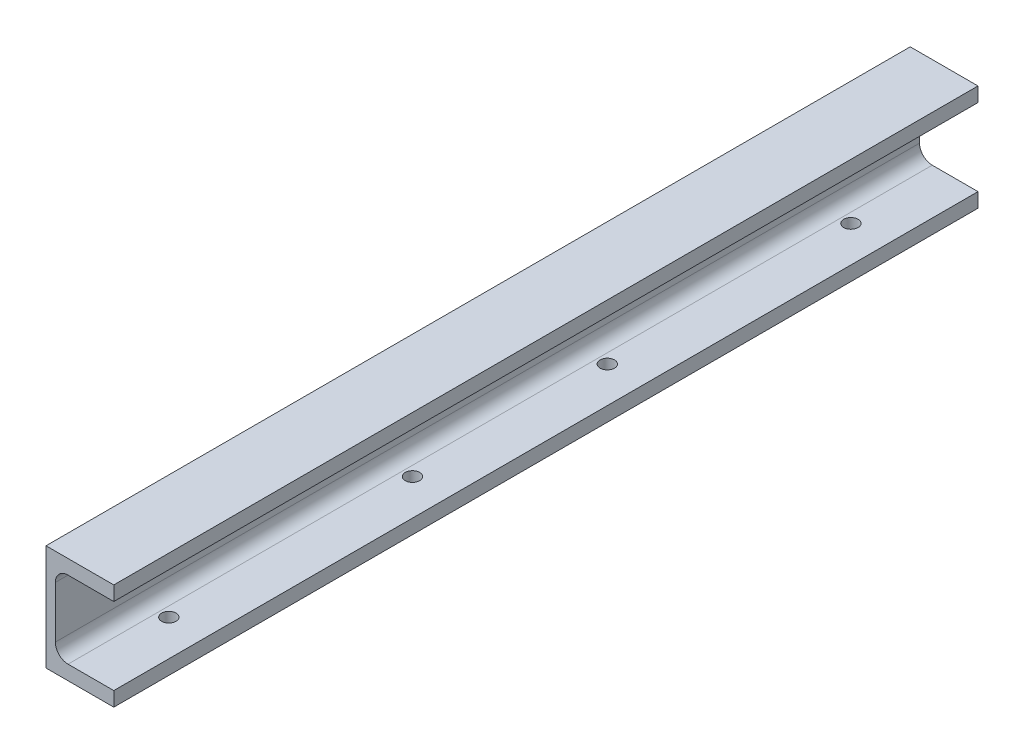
ISO-10303-21;
HEADER;
FILE_DESCRIPTION(('STEP AP214'),'2;1');
FILE_NAME('part.step','',(''),(''),'','','');
FILE_SCHEMA(('AUTOMOTIVE_DESIGN { 1 0 10303 214 1 1 1 1 }'));
ENDSEC;
DATA;
#1=APPLICATION_CONTEXT('core data for automotive mechanical design processes');
#2=APPLICATION_PROTOCOL_DEFINITION('international standard','automotive_design',2000,#1);
#3=PRODUCT_CONTEXT('',#1,'mechanical');
#4=PRODUCT('Part','Part','',(#3));
#5=PRODUCT_RELATED_PRODUCT_CATEGORY('part','',(#4));
#6=PRODUCT_DEFINITION_FORMATION('','',#4);
#7=PRODUCT_DEFINITION_CONTEXT('part definition',#1,'design');
#8=PRODUCT_DEFINITION('design','',#6,#7);
#9=PRODUCT_DEFINITION_SHAPE('','',#8);
#10=(LENGTH_UNIT() NAMED_UNIT(*) SI_UNIT(.MILLI.,.METRE.));
#11=(NAMED_UNIT(*) PLANE_ANGLE_UNIT() SI_UNIT($,.RADIAN.));
#12=(NAMED_UNIT(*) SI_UNIT($,.STERADIAN.) SOLID_ANGLE_UNIT());
#13=UNCERTAINTY_MEASURE_WITH_UNIT(LENGTH_MEASURE(1.E-05),#10,'distance_accuracy_value','');
#14=(GEOMETRIC_REPRESENTATION_CONTEXT(3) GLOBAL_UNCERTAINTY_ASSIGNED_CONTEXT((#13)) GLOBAL_UNIT_ASSIGNED_CONTEXT((#10,
#11,#12)) REPRESENTATION_CONTEXT('',''));
#15=CARTESIAN_POINT('',(0.,0.,0.));
#16=DIRECTION('',(0.,0.,1.));
#17=DIRECTION('',(1.,0.,0.));
#18=AXIS2_PLACEMENT_3D('',#15,#16,#17);
#19=CARTESIAN_POINT('',(-5.60000000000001,12.2,204.));
#20=DIRECTION('',(0.,0.,-1.));
#21=DIRECTION('',(-1.,0.,0.));
#22=AXIS2_PLACEMENT_3D('',#19,#20,#21);
#23=CYLINDRICAL_SURFACE('',#22,6.);
#24=CARTESIAN_POINT('',(-5.60000000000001,12.2,-204.));
#25=DIRECTION('',(0.,0.,-1.));
#26=DIRECTION('',(-1.,0.,0.));
#27=AXIS2_PLACEMENT_3D('',#24,#25,#26);
#28=CIRCLE('',#27,6.);
#29=CARTESIAN_POINT('',(-11.6,12.2,-204.));
#30=VERTEX_POINT('',#29);
#31=CARTESIAN_POINT('',(-5.60000000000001,18.2,-204.));
#32=VERTEX_POINT('',#31);
#33=EDGE_CURVE('E146',#30,#32,#28,.T.);
#34=ORIENTED_EDGE('',*,*,#33,.T.);
#35=DIRECTION('',(0.,0.,-1.));
#36=VECTOR('',#35,1.);
#37=CARTESIAN_POINT('',(-5.60000000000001,18.2,204.));
#38=LINE('',#37,#36);
#39=CARTESIAN_POINT('',(-5.60000000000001,18.2,204.));
#40=VERTEX_POINT('',#39);
#41=EDGE_CURVE('E11',#40,#32,#38,.T.);
#42=ORIENTED_EDGE('',*,*,#41,.F.);
#43=CARTESIAN_POINT('',(-5.60000000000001,12.2,204.));
#44=DIRECTION('',(0.,0.,-1.));
#45=DIRECTION('',(-1.,0.,0.));
#46=AXIS2_PLACEMENT_3D('',#43,#44,#45);
#47=CIRCLE('',#46,6.);
#48=CARTESIAN_POINT('',(-11.6,12.2,204.));
#49=VERTEX_POINT('',#48);
#50=EDGE_CURVE('E165',#49,#40,#47,.T.);
#51=ORIENTED_EDGE('',*,*,#50,.F.);
#52=DIRECTION('',(0.,0.,-1.));
#53=VECTOR('',#52,1.);
#54=CARTESIAN_POINT('',(-11.6,12.2,204.));
#55=LINE('',#54,#53);
#56=EDGE_CURVE('E142',#49,#30,#55,.T.);
#57=ORIENTED_EDGE('',*,*,#56,.T.);
#58=EDGE_LOOP('',(#34,#42,#51,#57));
#59=FACE_BOUND('',#58,.T.);
#60=ADVANCED_FACE('F36',(#59),#23,.F.);
#61=CARTESIAN_POINT('',(16.,18.2,204.));
#62=DIRECTION('',(0.,1.,0.));
#63=DIRECTION('',(0.,0.,1.));
#64=AXIS2_PLACEMENT_3D('',#61,#62,#63);
#65=PLANE('',#64);
#66=DIRECTION('',(1.,0.,0.));
#67=VECTOR('',#66,1.);
#68=CARTESIAN_POINT('',(16.,18.2,-204.));
#69=LINE('',#68,#67);
#70=CARTESIAN_POINT('',(16.,18.2,-204.));
#71=VERTEX_POINT('',#70);
#72=EDGE_CURVE('E149',#32,#71,#69,.T.);
#73=ORIENTED_EDGE('',*,*,#72,.T.);
#74=DIRECTION('',(0.,0.,-1.));
#75=VECTOR('',#74,1.);
#76=CARTESIAN_POINT('',(16.,18.2,204.));
#77=LINE('',#76,#75);
#78=CARTESIAN_POINT('',(16.,18.2,204.));
#79=VERTEX_POINT('',#78);
#80=EDGE_CURVE('E45',#79,#71,#77,.T.);
#81=ORIENTED_EDGE('',*,*,#80,.F.);
#82=DIRECTION('',(1.,0.,0.));
#83=VECTOR('',#82,1.);
#84=CARTESIAN_POINT('',(16.,18.2,204.));
#85=LINE('',#84,#83);
#86=EDGE_CURVE('E103',#40,#79,#85,.T.);
#87=ORIENTED_EDGE('',*,*,#86,.F.);
#88=ORIENTED_EDGE('',*,*,#41,.T.);
#89=EDGE_LOOP('',(#73,#81,#87,#88));
#90=FACE_BOUND('',#89,.T.);
#91=ADVANCED_FACE('F243',(#90),#65,.F.);
#92=CARTESIAN_POINT('',(16.,25.,204.));
#93=DIRECTION('',(-1.,0.,0.));
#94=DIRECTION('',(0.,0.,1.));
#95=AXIS2_PLACEMENT_3D('',#92,#93,#94);
#96=PLANE('',#95);
#97=DIRECTION('',(0.,1.,0.));
#98=VECTOR('',#97,1.);
#99=CARTESIAN_POINT('',(16.,25.,-204.));
#100=LINE('',#99,#98);
#101=CARTESIAN_POINT('',(16.,25.,-204.));
#102=VERTEX_POINT('',#101);
#103=EDGE_CURVE('E152',#71,#102,#100,.T.);
#104=ORIENTED_EDGE('',*,*,#103,.T.);
#105=DIRECTION('',(0.,0.,-1.));
#106=VECTOR('',#105,1.);
#107=CARTESIAN_POINT('',(16.,25.,204.));
#108=LINE('',#107,#106);
#109=CARTESIAN_POINT('',(16.,25.,204.));
#110=VERTEX_POINT('',#109);
#111=EDGE_CURVE('E178',#110,#102,#108,.T.);
#112=ORIENTED_EDGE('',*,*,#111,.F.);
#113=DIRECTION('',(0.,1.,0.));
#114=VECTOR('',#113,1.);
#115=CARTESIAN_POINT('',(16.,25.,204.));
#116=LINE('',#115,#114);
#117=EDGE_CURVE('E208',#79,#110,#116,.T.);
#118=ORIENTED_EDGE('',*,*,#117,.F.);
#119=ORIENTED_EDGE('',*,*,#80,.T.);
#120=EDGE_LOOP('',(#104,#112,#118,#119));
#121=FACE_BOUND('',#120,.T.);
#122=ADVANCED_FACE('F247',(#121),#96,.F.);
#123=CARTESIAN_POINT('',(-16.,25.,204.));
#124=DIRECTION('',(0.,-1.,0.));
#125=DIRECTION('',(0.,0.,-1.));
#126=AXIS2_PLACEMENT_3D('',#123,#124,#125);
#127=PLANE('',#126);
#128=DIRECTION('',(-1.,0.,0.));
#129=VECTOR('',#128,1.);
#130=CARTESIAN_POINT('',(-16.,25.,-204.));
#131=LINE('',#130,#129);
#132=CARTESIAN_POINT('',(-16.,25.,-204.));
#133=VERTEX_POINT('',#132);
#134=EDGE_CURVE('E154',#102,#133,#131,.T.);
#135=ORIENTED_EDGE('',*,*,#134,.T.);
#136=DIRECTION('',(0.,0.,-1.));
#137=VECTOR('',#136,1.);
#138=CARTESIAN_POINT('',(-16.,25.,204.));
#139=LINE('',#138,#137);
#140=CARTESIAN_POINT('',(-16.,25.,204.));
#141=VERTEX_POINT('',#140);
#142=EDGE_CURVE('E175',#141,#133,#139,.T.);
#143=ORIENTED_EDGE('',*,*,#142,.F.);
#144=DIRECTION('',(-1.,0.,0.));
#145=VECTOR('',#144,1.);
#146=CARTESIAN_POINT('',(-16.,25.,204.));
#147=LINE('',#146,#145);
#148=EDGE_CURVE('E210',#110,#141,#147,.T.);
#149=ORIENTED_EDGE('',*,*,#148,.F.);
#150=ORIENTED_EDGE('',*,*,#111,.T.);
#151=EDGE_LOOP('',(#135,#143,#149,#150));
#152=FACE_BOUND('',#151,.T.);
#153=ADVANCED_FACE('F251',(#152),#127,.F.);
#154=CARTESIAN_POINT('',(-16.,25.,204.));
#155=DIRECTION('',(1.,0.,0.));
#156=DIRECTION('',(0.,0.,-1.));
#157=AXIS2_PLACEMENT_3D('',#154,#155,#156);
#158=PLANE('',#157);
#159=DIRECTION('',(0.,-1.,0.));
#160=VECTOR('',#159,1.);
#161=CARTESIAN_POINT('',(-16.,25.,-204.));
#162=LINE('',#161,#160);
#163=CARTESIAN_POINT('',(-16.,-25.,-204.));
#164=VERTEX_POINT('',#163);
#165=EDGE_CURVE('E156',#133,#164,#162,.T.);
#166=ORIENTED_EDGE('',*,*,#165,.T.);
#167=DIRECTION('',(0.,0.,-1.));
#168=VECTOR('',#167,1.);
#169=CARTESIAN_POINT('',(-16.,-25.,204.));
#170=LINE('',#169,#168);
#171=CARTESIAN_POINT('',(-16.,-25.,204.));
#172=VERTEX_POINT('',#171);
#173=EDGE_CURVE('E172',#172,#164,#170,.T.);
#174=ORIENTED_EDGE('',*,*,#173,.F.);
#175=DIRECTION('',(0.,-1.,0.));
#176=VECTOR('',#175,1.);
#177=CARTESIAN_POINT('',(-16.,25.,204.));
#178=LINE('',#177,#176);
#179=EDGE_CURVE('E212',#141,#172,#178,.T.);
#180=ORIENTED_EDGE('',*,*,#179,.F.);
#181=ORIENTED_EDGE('',*,*,#142,.T.);
#182=EDGE_LOOP('',(#166,#174,#180,#181));
#183=FACE_BOUND('',#182,.T.);
#184=ADVANCED_FACE('F257',(#183),#158,.F.);
#185=CARTESIAN_POINT('',(-16.,-25.,204.));
#186=DIRECTION('',(0.,1.,0.));
#187=DIRECTION('',(0.,0.,1.));
#188=AXIS2_PLACEMENT_3D('',#185,#186,#187);
#189=PLANE('',#188);
#190=CARTESIAN_POINT('',(-1.,-25.,161.));
#191=DIRECTION('',(0.,-1.,0.));
#192=DIRECTION('',(0.,0.,-1.));
#193=AXIS2_PLACEMENT_3D('',#190,#191,#192);
#194=CIRCLE('',#193,3.39999999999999);
#195=CARTESIAN_POINT('',(-1.,-25.,157.6));
#196=VERTEX_POINT('',#195);
#197=EDGE_CURVE('E199',#196,#196,#194,.T.);
#198=ORIENTED_EDGE('',*,*,#197,.F.);
#199=EDGE_LOOP('',(#198));
#200=FACE_BOUND('',#199,.T.);
#201=CARTESIAN_POINT('',(-1.,-25.,46.));
#202=DIRECTION('',(0.,-1.,0.));
#203=DIRECTION('',(0.,0.,-1.));
#204=AXIS2_PLACEMENT_3D('',#201,#202,#203);
#205=CIRCLE('',#204,3.39999999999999);
#206=CARTESIAN_POINT('',(-1.,-25.,42.6));
#207=VERTEX_POINT('',#206);
#208=EDGE_CURVE('E189',#207,#207,#205,.T.);
#209=ORIENTED_EDGE('',*,*,#208,.F.);
#210=EDGE_LOOP('',(#209));
#211=FACE_BOUND('',#210,.T.);
#212=CARTESIAN_POINT('',(-1.,-25.,-46.));
#213=DIRECTION('',(0.,-1.,0.));
#214=DIRECTION('',(0.,0.,-1.));
#215=AXIS2_PLACEMENT_3D('',#212,#213,#214);
#216=CIRCLE('',#215,3.39999999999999);
#217=CARTESIAN_POINT('',(-1.,-25.,-49.4));
#218=VERTEX_POINT('',#217);
#219=EDGE_CURVE('E186',#218,#218,#216,.T.);
#220=ORIENTED_EDGE('',*,*,#219,.F.);
#221=EDGE_LOOP('',(#220));
#222=FACE_BOUND('',#221,.T.);
#223=CARTESIAN_POINT('',(-1.,-25.,-161.));
#224=DIRECTION('',(0.,-1.,0.));
#225=DIRECTION('',(0.,0.,-1.));
#226=AXIS2_PLACEMENT_3D('',#223,#224,#225);
#227=CIRCLE('',#226,3.39999999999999);
#228=CARTESIAN_POINT('',(-1.,-25.,-164.4));
#229=VERTEX_POINT('',#228);
#230=EDGE_CURVE('E185',#229,#229,#227,.T.);
#231=ORIENTED_EDGE('',*,*,#230,.F.);
#232=EDGE_LOOP('',(#231));
#233=FACE_BOUND('',#232,.T.);
#234=DIRECTION('',(1.,0.,0.));
#235=VECTOR('',#234,1.);
#236=CARTESIAN_POINT('',(-16.,-25.,-204.));
#237=LINE('',#236,#235);
#238=CARTESIAN_POINT('',(16.,-25.,-204.));
#239=VERTEX_POINT('',#238);
#240=EDGE_CURVE('E158',#164,#239,#237,.T.);
#241=ORIENTED_EDGE('',*,*,#240,.T.);
#242=DIRECTION('',(0.,0.,-1.));
#243=VECTOR('',#242,1.);
#244=CARTESIAN_POINT('',(16.,-25.,204.));
#245=LINE('',#244,#243);
#246=CARTESIAN_POINT('',(16.,-25.,204.));
#247=VERTEX_POINT('',#246);
#248=EDGE_CURVE('E169',#247,#239,#245,.T.);
#249=ORIENTED_EDGE('',*,*,#248,.F.);
#250=DIRECTION('',(1.,0.,0.));
#251=VECTOR('',#250,1.);
#252=CARTESIAN_POINT('',(-16.,-25.,204.));
#253=LINE('',#252,#251);
#254=EDGE_CURVE('E214',#172,#247,#253,.T.);
#255=ORIENTED_EDGE('',*,*,#254,.F.);
#256=ORIENTED_EDGE('',*,*,#173,.T.);
#257=EDGE_LOOP('',(#241,#249,#255,#256));
#258=FACE_BOUND('',#257,.T.);
#259=ADVANCED_FACE('F220',(#200,#211,#222,#233,#258),#189,.F.);
#260=CARTESIAN_POINT('',(16.,-18.2,204.));
#261=DIRECTION('',(-1.,0.,0.));
#262=DIRECTION('',(0.,0.,1.));
#263=AXIS2_PLACEMENT_3D('',#260,#261,#262);
#264=PLANE('',#263);
#265=DIRECTION('',(0.,1.,0.));
#266=VECTOR('',#265,1.);
#267=CARTESIAN_POINT('',(16.,-18.2,-204.));
#268=LINE('',#267,#266);
#269=CARTESIAN_POINT('',(16.,-18.2,-204.));
#270=VERTEX_POINT('',#269);
#271=EDGE_CURVE('E160',#239,#270,#268,.T.);
#272=ORIENTED_EDGE('',*,*,#271,.T.);
#273=DIRECTION('',(0.,0.,-1.));
#274=VECTOR('',#273,1.);
#275=CARTESIAN_POINT('',(16.,-18.2,204.));
#276=LINE('',#275,#274);
#277=CARTESIAN_POINT('',(16.,-18.2,204.));
#278=VERTEX_POINT('',#277);
#279=EDGE_CURVE('E137',#278,#270,#276,.T.);
#280=ORIENTED_EDGE('',*,*,#279,.F.);
#281=DIRECTION('',(0.,1.,0.));
#282=VECTOR('',#281,1.);
#283=CARTESIAN_POINT('',(16.,-18.2,204.));
#284=LINE('',#283,#282);
#285=EDGE_CURVE('E128',#247,#278,#284,.T.);
#286=ORIENTED_EDGE('',*,*,#285,.F.);
#287=ORIENTED_EDGE('',*,*,#248,.T.);
#288=EDGE_LOOP('',(#272,#280,#286,#287));
#289=FACE_BOUND('',#288,.T.);
#290=ADVANCED_FACE('F224',(#289),#264,.F.);
#291=CARTESIAN_POINT('',(-5.60000000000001,-18.2,204.));
#292=DIRECTION('',(0.,-1.,0.));
#293=DIRECTION('',(0.,0.,-1.));
#294=AXIS2_PLACEMENT_3D('',#291,#292,#293);
#295=PLANE('',#294);
#296=CARTESIAN_POINT('',(-1.,-18.2,161.));
#297=DIRECTION('',(0.,-1.,0.));
#298=DIRECTION('',(0.,0.,-1.));
#299=AXIS2_PLACEMENT_3D('',#296,#297,#298);
#300=CIRCLE('',#299,3.39999999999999);
#301=CARTESIAN_POINT('',(-1.,-18.2,157.6));
#302=VERTEX_POINT('',#301);
#303=EDGE_CURVE('E39',#302,#302,#300,.T.);
#304=ORIENTED_EDGE('',*,*,#303,.T.);
#305=EDGE_LOOP('',(#304));
#306=FACE_BOUND('',#305,.T.);
#307=CARTESIAN_POINT('',(-1.,-18.2,46.));
#308=DIRECTION('',(0.,-1.,0.));
#309=DIRECTION('',(0.,0.,-1.));
#310=AXIS2_PLACEMENT_3D('',#307,#308,#309);
#311=CIRCLE('',#310,3.39999999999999);
#312=CARTESIAN_POINT('',(-1.,-18.2,42.6));
#313=VERTEX_POINT('',#312);
#314=EDGE_CURVE('E187',#313,#313,#311,.T.);
#315=ORIENTED_EDGE('',*,*,#314,.T.);
#316=EDGE_LOOP('',(#315));
#317=FACE_BOUND('',#316,.T.);
#318=CARTESIAN_POINT('',(-1.,-18.2,-46.));
#319=DIRECTION('',(0.,-1.,0.));
#320=DIRECTION('',(0.,0.,-1.));
#321=AXIS2_PLACEMENT_3D('',#318,#319,#320);
#322=CIRCLE('',#321,3.39999999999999);
#323=CARTESIAN_POINT('',(-1.,-18.2,-49.4));
#324=VERTEX_POINT('',#323);
#325=EDGE_CURVE('E183',#324,#324,#322,.T.);
#326=ORIENTED_EDGE('',*,*,#325,.T.);
#327=EDGE_LOOP('',(#326));
#328=FACE_BOUND('',#327,.T.);
#329=CARTESIAN_POINT('',(-1.,-18.2,-161.));
#330=DIRECTION('',(0.,-1.,0.));
#331=DIRECTION('',(0.,0.,-1.));
#332=AXIS2_PLACEMENT_3D('',#329,#330,#331);
#333=CIRCLE('',#332,3.39999999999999);
#334=CARTESIAN_POINT('',(-1.,-18.2,-164.4));
#335=VERTEX_POINT('',#334);
#336=EDGE_CURVE('E150',#335,#335,#333,.T.);
#337=ORIENTED_EDGE('',*,*,#336,.T.);
#338=EDGE_LOOP('',(#337));
#339=FACE_BOUND('',#338,.T.);
#340=DIRECTION('',(-1.,0.,0.));
#341=VECTOR('',#340,1.);
#342=CARTESIAN_POINT('',(-5.60000000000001,-18.2,-204.));
#343=LINE('',#342,#341);
#344=CARTESIAN_POINT('',(-5.60000000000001,-18.2,-204.));
#345=VERTEX_POINT('',#344);
#346=EDGE_CURVE('E136',#270,#345,#343,.T.);
#347=ORIENTED_EDGE('',*,*,#346,.T.);
#348=DIRECTION('',(0.,0.,-1.));
#349=VECTOR('',#348,1.);
#350=CARTESIAN_POINT('',(-5.60000000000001,-18.2,204.));
#351=LINE('',#350,#349);
#352=CARTESIAN_POINT('',(-5.60000000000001,-18.2,204.));
#353=VERTEX_POINT('',#352);
#354=EDGE_CURVE('E133',#353,#345,#351,.T.);
#355=ORIENTED_EDGE('',*,*,#354,.F.);
#356=DIRECTION('',(-1.,0.,0.));
#357=VECTOR('',#356,1.);
#358=CARTESIAN_POINT('',(-5.60000000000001,-18.2,204.));
#359=LINE('',#358,#357);
#360=EDGE_CURVE('E122',#278,#353,#359,.T.);
#361=ORIENTED_EDGE('',*,*,#360,.F.);
#362=ORIENTED_EDGE('',*,*,#279,.T.);
#363=EDGE_LOOP('',(#347,#355,#361,#362));
#364=FACE_BOUND('',#363,.T.);
#365=ADVANCED_FACE('F134',(#306,#317,#328,#339,#364),#295,.F.);
#366=CARTESIAN_POINT('',(-5.60000000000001,-12.2,204.));
#367=DIRECTION('',(0.,0.,-1.));
#368=DIRECTION('',(-1.,0.,0.));
#369=AXIS2_PLACEMENT_3D('',#366,#367,#368);
#370=CYLINDRICAL_SURFACE('',#369,6.);
#371=CARTESIAN_POINT('',(-5.60000000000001,-12.2,-204.));
#372=DIRECTION('',(0.,0.,-1.));
#373=DIRECTION('',(1.,0.,0.));
#374=AXIS2_PLACEMENT_3D('',#371,#372,#373);
#375=CIRCLE('',#374,6.);
#376=CARTESIAN_POINT('',(-11.6,-12.2,-204.));
#377=VERTEX_POINT('',#376);
#378=EDGE_CURVE('E89',#345,#377,#375,.T.);
#379=ORIENTED_EDGE('',*,*,#378,.T.);
#380=DIRECTION('',(0.,0.,-1.));
#381=VECTOR('',#380,1.);
#382=CARTESIAN_POINT('',(-11.6,-12.2,204.));
#383=LINE('',#382,#381);
#384=CARTESIAN_POINT('',(-11.6,-12.2,204.));
#385=VERTEX_POINT('',#384);
#386=EDGE_CURVE('E138',#385,#377,#383,.T.);
#387=ORIENTED_EDGE('',*,*,#386,.F.);
#388=CARTESIAN_POINT('',(-5.60000000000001,-12.2,204.));
#389=DIRECTION('',(0.,0.,-1.));
#390=DIRECTION('',(1.,0.,0.));
#391=AXIS2_PLACEMENT_3D('',#388,#389,#390);
#392=CIRCLE('',#391,6.);
#393=EDGE_CURVE('E126',#353,#385,#392,.T.);
#394=ORIENTED_EDGE('',*,*,#393,.F.);
#395=ORIENTED_EDGE('',*,*,#354,.T.);
#396=EDGE_LOOP('',(#379,#387,#394,#395));
#397=FACE_BOUND('',#396,.T.);
#398=ADVANCED_FACE('F140',(#397),#370,.F.);
#399=CARTESIAN_POINT('',(-11.6,12.2,204.));
#400=DIRECTION('',(-1.,0.,0.));
#401=DIRECTION('',(0.,0.,1.));
#402=AXIS2_PLACEMENT_3D('',#399,#400,#401);
#403=PLANE('',#402);
#404=DIRECTION('',(0.,1.,0.));
#405=VECTOR('',#404,1.);
#406=CARTESIAN_POINT('',(-11.6,12.2,-204.));
#407=LINE('',#406,#405);
#408=EDGE_CURVE('E95',#377,#30,#407,.T.);
#409=ORIENTED_EDGE('',*,*,#408,.T.);
#410=ORIENTED_EDGE('',*,*,#56,.F.);
#411=DIRECTION('',(0.,1.,0.));
#412=VECTOR('',#411,1.);
#413=CARTESIAN_POINT('',(-11.6,12.2,204.));
#414=LINE('',#413,#412);
#415=EDGE_CURVE('E54',#385,#49,#414,.T.);
#416=ORIENTED_EDGE('',*,*,#415,.F.);
#417=ORIENTED_EDGE('',*,*,#386,.T.);
#418=EDGE_LOOP('',(#409,#410,#416,#417));
#419=FACE_BOUND('',#418,.T.);
#420=ADVANCED_FACE('F232',(#419),#403,.F.);
#421=CARTESIAN_POINT('',(-5.60000000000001,12.2,204.));
#422=DIRECTION('',(0.,0.,-1.));
#423=DIRECTION('',(-1.,0.,0.));
#424=AXIS2_PLACEMENT_3D('',#421,#422,#423);
#425=PLANE('',#424);
#426=ORIENTED_EDGE('',*,*,#50,.T.);
#427=ORIENTED_EDGE('',*,*,#86,.T.);
#428=ORIENTED_EDGE('',*,*,#117,.T.);
#429=ORIENTED_EDGE('',*,*,#148,.T.);
#430=ORIENTED_EDGE('',*,*,#179,.T.);
#431=ORIENTED_EDGE('',*,*,#254,.T.);
#432=ORIENTED_EDGE('',*,*,#285,.T.);
#433=ORIENTED_EDGE('',*,*,#360,.T.);
#434=ORIENTED_EDGE('',*,*,#393,.T.);
#435=ORIENTED_EDGE('',*,*,#415,.T.);
#436=EDGE_LOOP('',(#426,#427,#428,#429,#430,#431,#432,#433,#434,#435));
#437=FACE_BOUND('',#436,.T.);
#438=ADVANCED_FACE('F124',(#437),#425,.F.);
#439=CARTESIAN_POINT('',(-5.60000000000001,12.2,-204.));
#440=DIRECTION('',(0.,0.,-1.));
#441=DIRECTION('',(-1.,0.,0.));
#442=AXIS2_PLACEMENT_3D('',#439,#440,#441);
#443=PLANE('',#442);
#444=ORIENTED_EDGE('',*,*,#33,.F.);
#445=ORIENTED_EDGE('',*,*,#408,.F.);
#446=ORIENTED_EDGE('',*,*,#378,.F.);
#447=ORIENTED_EDGE('',*,*,#346,.F.);
#448=ORIENTED_EDGE('',*,*,#271,.F.);
#449=ORIENTED_EDGE('',*,*,#240,.F.);
#450=ORIENTED_EDGE('',*,*,#165,.F.);
#451=ORIENTED_EDGE('',*,*,#134,.F.);
#452=ORIENTED_EDGE('',*,*,#103,.F.);
#453=ORIENTED_EDGE('',*,*,#72,.F.);
#454=EDGE_LOOP('',(#444,#445,#446,#447,#448,#449,#450,#451,#452,#453));
#455=FACE_BOUND('',#454,.T.);
#456=ADVANCED_FACE('F227',(#455),#443,.T.);
#457=CARTESIAN_POINT('',(-1.,-25.,-161.));
#458=DIRECTION('',(0.,-1.,0.));
#459=DIRECTION('',(0.,0.,-1.));
#460=AXIS2_PLACEMENT_3D('',#457,#458,#459);
#461=CYLINDRICAL_SURFACE('',#460,3.39999999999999);
#462=ORIENTED_EDGE('',*,*,#230,.T.);
#463=EDGE_LOOP('',(#462));
#464=FACE_BOUND('',#463,.T.);
#465=ORIENTED_EDGE('',*,*,#336,.F.);
#466=EDGE_LOOP('',(#465));
#467=FACE_BOUND('',#466,.T.);
#468=ADVANCED_FACE('F277',(#464,#467),#461,.F.);
#469=CARTESIAN_POINT('',(-1.,-25.,-46.));
#470=DIRECTION('',(0.,-1.,0.));
#471=DIRECTION('',(0.,0.,-1.));
#472=AXIS2_PLACEMENT_3D('',#469,#470,#471);
#473=CYLINDRICAL_SURFACE('',#472,3.39999999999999);
#474=ORIENTED_EDGE('',*,*,#219,.T.);
#475=EDGE_LOOP('',(#474));
#476=FACE_BOUND('',#475,.T.);
#477=ORIENTED_EDGE('',*,*,#325,.F.);
#478=EDGE_LOOP('',(#477));
#479=FACE_BOUND('',#478,.T.);
#480=ADVANCED_FACE('F279',(#476,#479),#473,.F.);
#481=CARTESIAN_POINT('',(-1.,-25.,46.));
#482=DIRECTION('',(0.,-1.,0.));
#483=DIRECTION('',(0.,0.,-1.));
#484=AXIS2_PLACEMENT_3D('',#481,#482,#483);
#485=CYLINDRICAL_SURFACE('',#484,3.39999999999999);
#486=ORIENTED_EDGE('',*,*,#208,.T.);
#487=EDGE_LOOP('',(#486));
#488=FACE_BOUND('',#487,.T.);
#489=ORIENTED_EDGE('',*,*,#314,.F.);
#490=EDGE_LOOP('',(#489));
#491=FACE_BOUND('',#490,.T.);
#492=ADVANCED_FACE('F286',(#488,#491),#485,.F.);
#493=CARTESIAN_POINT('',(-1.,-25.,161.));
#494=DIRECTION('',(0.,-1.,0.));
#495=DIRECTION('',(0.,0.,-1.));
#496=AXIS2_PLACEMENT_3D('',#493,#494,#495);
#497=CYLINDRICAL_SURFACE('',#496,3.39999999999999);
#498=ORIENTED_EDGE('',*,*,#197,.T.);
#499=EDGE_LOOP('',(#498));
#500=FACE_BOUND('',#499,.T.);
#501=ORIENTED_EDGE('',*,*,#303,.F.);
#502=EDGE_LOOP('',(#501));
#503=FACE_BOUND('',#502,.T.);
#504=ADVANCED_FACE('F292',(#500,#503),#497,.F.);
#505=CLOSED_SHELL('',(#60,#91,#122,#153,#184,#259,#290,#365,#398,#420,#438,#456,#468,#480,#492,#504));
#506=MANIFOLD_SOLID_BREP('B2',#505);
#507=ADVANCED_BREP_SHAPE_REPRESENTATION('',(#18,#506),#14);
#508=SHAPE_DEFINITION_REPRESENTATION(#9,#507);
ENDSEC;
END-ISO-10303-21;
